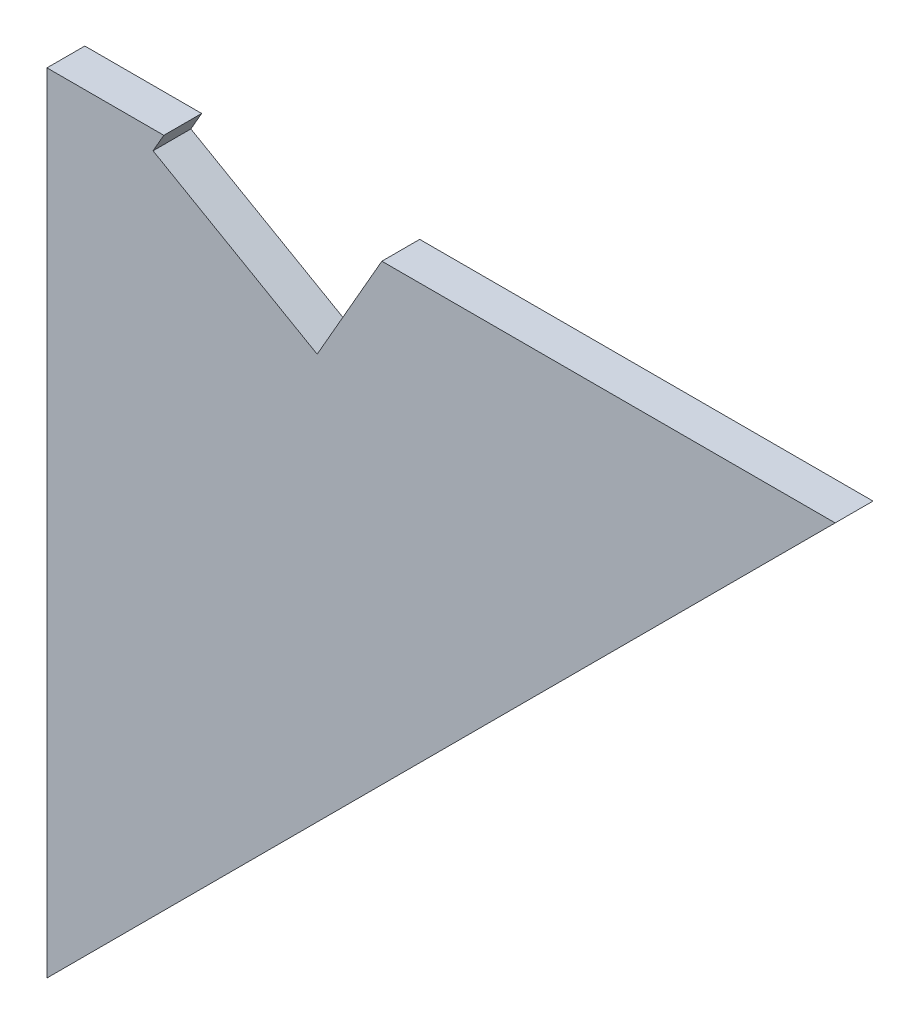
ISO-10303-21;
HEADER;
FILE_DESCRIPTION(('STEP AP214'),'2;1');
FILE_NAME('part.step','',(''),(''),'','','');
FILE_SCHEMA(('AUTOMOTIVE_DESIGN { 1 0 10303 214 1 1 1 1 }'));
ENDSEC;
DATA;
#1=APPLICATION_CONTEXT('core data for automotive mechanical design processes');
#2=APPLICATION_PROTOCOL_DEFINITION('international standard','automotive_design',2000,#1);
#3=PRODUCT_CONTEXT('',#1,'mechanical');
#4=PRODUCT('Part','Part','',(#3));
#5=PRODUCT_RELATED_PRODUCT_CATEGORY('part','',(#4));
#6=PRODUCT_DEFINITION_FORMATION('','',#4);
#7=PRODUCT_DEFINITION_CONTEXT('part definition',#1,'design');
#8=PRODUCT_DEFINITION('design','',#6,#7);
#9=PRODUCT_DEFINITION_SHAPE('','',#8);
#10=(LENGTH_UNIT() NAMED_UNIT(*) SI_UNIT(.MILLI.,.METRE.));
#11=(NAMED_UNIT(*) PLANE_ANGLE_UNIT() SI_UNIT($,.RADIAN.));
#12=(NAMED_UNIT(*) SI_UNIT($,.STERADIAN.) SOLID_ANGLE_UNIT());
#13=UNCERTAINTY_MEASURE_WITH_UNIT(LENGTH_MEASURE(1.E-05),#10,'distance_accuracy_value','');
#14=(GEOMETRIC_REPRESENTATION_CONTEXT(3) GLOBAL_UNCERTAINTY_ASSIGNED_CONTEXT((#13)) GLOBAL_UNIT_ASSIGNED_CONTEXT((#10,
#11,#12)) REPRESENTATION_CONTEXT('',''));
#15=CARTESIAN_POINT('',(0.,0.,0.));
#16=DIRECTION('',(0.,0.,1.));
#17=DIRECTION('',(1.,0.,0.));
#18=AXIS2_PLACEMENT_3D('',#15,#16,#17);
#19=CARTESIAN_POINT('',(85.6976168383,89.196291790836,36.001));
#20=DIRECTION('',(0.497235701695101,0.867615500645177,0.));
#21=DIRECTION('',(0.,0.,-1.));
#22=AXIS2_PLACEMENT_3D('',#19,#20,#21);
#23=PLANE('',#22);
#24=DIRECTION('',(0.,0.,-1.));
#25=VECTOR('',#24,1.);
#26=CARTESIAN_POINT('',(33.638951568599,119.03142836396,36.001));
#27=LINE('',#26,#25);
#28=CARTESIAN_POINT('',(33.638951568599,119.03142836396,12.));
#29=VERTEX_POINT('',#28);
#30=CARTESIAN_POINT('',(33.638951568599,119.03142836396,0.));
#31=VERTEX_POINT('',#30);
#32=EDGE_CURVE('E25',#29,#31,#27,.T.);
#33=ORIENTED_EDGE('',*,*,#32,.F.);
#34=DIRECTION('',(0.867615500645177,-0.497235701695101,0.));
#35=VECTOR('',#34,1.);
#36=CARTESIAN_POINT('',(98.053103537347,82.115287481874,12.));
#37=LINE('',#36,#35);
#38=CARTESIAN_POINT('',(85.6976168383,89.196291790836,12.));
#39=VERTEX_POINT('',#38);
#40=EDGE_CURVE('E91',#29,#39,#37,.T.);
#41=ORIENTED_EDGE('',*,*,#40,.T.);
#42=DIRECTION('',(0.,0.,-1.));
#43=VECTOR('',#42,1.);
#44=CARTESIAN_POINT('',(85.6976168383,89.196291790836,36.001));
#45=LINE('',#44,#43);
#46=CARTESIAN_POINT('',(85.6976168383,89.196291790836,0.));
#47=VERTEX_POINT('',#46);
#48=EDGE_CURVE('E10',#39,#47,#45,.T.);
#49=ORIENTED_EDGE('',*,*,#48,.T.);
#50=DIRECTION('',(0.867615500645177,-0.497235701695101,0.));
#51=VECTOR('',#50,1.);
#52=CARTESIAN_POINT('',(98.053103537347,82.115287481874,0.));
#53=LINE('',#52,#51);
#54=EDGE_CURVE('E107',#31,#47,#53,.T.);
#55=ORIENTED_EDGE('',*,*,#54,.F.);
#56=EDGE_LOOP('',(#33,#41,#49,#55));
#57=FACE_BOUND('',#56,.T.);
#58=ADVANCED_FACE('F16',(#57),#23,.T.);
#59=CARTESIAN_POINT('',(85.6976168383,89.196291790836,36.001));
#60=DIRECTION('',(-0.867615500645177,0.497235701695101,0.));
#61=DIRECTION('',(0.,0.,1.));
#62=AXIS2_PLACEMENT_3D('',#59,#60,#61);
#63=PLANE('',#62);
#64=ORIENTED_EDGE('',*,*,#48,.F.);
#65=DIRECTION('',(0.497235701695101,0.867615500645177,0.));
#66=VECTOR('',#65,1.);
#67=CARTESIAN_POINT('',(74.687495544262,69.98497638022,12.));
#68=LINE('',#67,#66);
#69=CARTESIAN_POINT('',(106.21693900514,125.,12.));
#70=VERTEX_POINT('',#69);
#71=EDGE_CURVE('E86',#39,#70,#68,.T.);
#72=ORIENTED_EDGE('',*,*,#71,.T.);
#73=DIRECTION('',(0.,0.,1.));
#74=VECTOR('',#73,1.);
#75=CARTESIAN_POINT('',(106.21693900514,125.,18.0005));
#76=LINE('',#75,#74);
#77=CARTESIAN_POINT('',(106.21693900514,125.,0.));
#78=VERTEX_POINT('',#77);
#79=EDGE_CURVE('E70',#78,#70,#76,.T.);
#80=ORIENTED_EDGE('',*,*,#79,.F.);
#81=DIRECTION('',(0.497235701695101,0.867615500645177,0.));
#82=VECTOR('',#81,1.);
#83=CARTESIAN_POINT('',(74.687495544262,69.98497638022,0.));
#84=LINE('',#83,#82);
#85=EDGE_CURVE('E103',#47,#78,#84,.T.);
#86=ORIENTED_EDGE('',*,*,#85,.F.);
#87=EDGE_LOOP('',(#64,#72,#80,#86));
#88=FACE_BOUND('',#87,.T.);
#89=ADVANCED_FACE('F87',(#88),#63,.T.);
#90=CARTESIAN_POINT('',(33.638951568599,119.03142836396,36.001));
#91=DIRECTION('',(-0.867615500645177,0.497235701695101,0.));
#92=DIRECTION('',(0.,0.,1.));
#93=AXIS2_PLACEMENT_3D('',#90,#91,#92);
#94=PLANE('',#93);
#95=DIRECTION('',(0.497235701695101,0.867615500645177,0.));
#96=VECTOR('',#95,1.);
#97=CARTESIAN_POINT('',(22.62883027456,99.820112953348,0.));
#98=LINE('',#97,#96);
#99=CARTESIAN_POINT('',(37.059576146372,125.,0.));
#100=VERTEX_POINT('',#99);
#101=EDGE_CURVE('E116',#31,#100,#98,.T.);
#102=ORIENTED_EDGE('',*,*,#101,.T.);
#103=DIRECTION('',(0.,0.,1.));
#104=VECTOR('',#103,1.);
#105=CARTESIAN_POINT('',(37.059576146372,125.,18.0005));
#106=LINE('',#105,#104);
#107=CARTESIAN_POINT('',(37.059576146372,125.,12.));
#108=VERTEX_POINT('',#107);
#109=EDGE_CURVE('E129',#100,#108,#106,.T.);
#110=ORIENTED_EDGE('',*,*,#109,.T.);
#111=DIRECTION('',(0.497235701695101,0.867615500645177,0.));
#112=VECTOR('',#111,1.);
#113=CARTESIAN_POINT('',(22.62883027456,99.820112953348,12.));
#114=LINE('',#113,#112);
#115=EDGE_CURVE('E83',#29,#108,#114,.T.);
#116=ORIENTED_EDGE('',*,*,#115,.F.);
#117=ORIENTED_EDGE('',*,*,#32,.T.);
#118=EDGE_LOOP('',(#102,#110,#116,#117));
#119=FACE_BOUND('',#118,.T.);
#120=ADVANCED_FACE('F113',(#119),#94,.F.);
#121=CARTESIAN_POINT('',(0.,125.,0.));
#122=DIRECTION('',(0.,1.,0.));
#123=DIRECTION('',(1.,0.,0.));
#124=AXIS2_PLACEMENT_3D('',#121,#122,#123);
#125=PLANE('',#124);
#126=DIRECTION('',(1.,0.,0.));
#127=VECTOR('',#126,1.);
#128=CARTESIAN_POINT('',(0.,125.,0.));
#129=LINE('',#128,#127);
#130=CARTESIAN_POINT('',(250.,125.,0.));
#131=VERTEX_POINT('',#130);
#132=EDGE_CURVE('E78',#78,#131,#129,.T.);
#133=ORIENTED_EDGE('',*,*,#132,.F.);
#134=ORIENTED_EDGE('',*,*,#79,.T.);
#135=DIRECTION('',(1.,0.,0.));
#136=VECTOR('',#135,1.);
#137=CARTESIAN_POINT('',(0.,125.,12.));
#138=LINE('',#137,#136);
#139=CARTESIAN_POINT('',(250.,125.,12.));
#140=VERTEX_POINT('',#139);
#141=EDGE_CURVE('E75',#70,#140,#138,.T.);
#142=ORIENTED_EDGE('',*,*,#141,.T.);
#143=DIRECTION('',(0.,0.,1.));
#144=VECTOR('',#143,1.);
#145=CARTESIAN_POINT('',(250.,125.,0.));
#146=LINE('',#145,#144);
#147=EDGE_CURVE('E140',#131,#140,#146,.T.);
#148=ORIENTED_EDGE('',*,*,#147,.F.);
#149=EDGE_LOOP('',(#133,#134,#142,#148));
#150=FACE_BOUND('',#149,.T.);
#151=ADVANCED_FACE('F72',(#150),#125,.T.);
#152=CARTESIAN_POINT('',(88.388347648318,36.611652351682,12.));
#153=DIRECTION('',(0.,0.,-1.));
#154=DIRECTION('',(0.,-1.,0.));
#155=AXIS2_PLACEMENT_3D('',#152,#153,#154);
#156=PLANE('',#155);
#157=ORIENTED_EDGE('',*,*,#141,.F.);
#158=ORIENTED_EDGE('',*,*,#71,.F.);
#159=ORIENTED_EDGE('',*,*,#40,.F.);
#160=ORIENTED_EDGE('',*,*,#115,.T.);
#161=DIRECTION('',(1.,0.,0.));
#162=VECTOR('',#161,1.);
#163=CARTESIAN_POINT('',(0.,125.,12.));
#164=LINE('',#163,#162);
#165=CARTESIAN_POINT('',(0.,125.,12.));
#166=VERTEX_POINT('',#165);
#167=EDGE_CURVE('E133',#166,#108,#164,.T.);
#168=ORIENTED_EDGE('',*,*,#167,.F.);
#169=DIRECTION('',(0.,1.,0.));
#170=VECTOR('',#169,1.);
#171=CARTESIAN_POINT('',(0.,-125.,12.));
#172=LINE('',#171,#170);
#173=CARTESIAN_POINT('',(0.,-125.,12.));
#174=VERTEX_POINT('',#173);
#175=EDGE_CURVE('E155',#174,#166,#172,.T.);
#176=ORIENTED_EDGE('',*,*,#175,.F.);
#177=DIRECTION('',(-0.707106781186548,-0.707106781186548,0.));
#178=VECTOR('',#177,1.);
#179=CARTESIAN_POINT('',(250.,125.,12.));
#180=LINE('',#179,#178);
#181=EDGE_CURVE('E96',#140,#174,#180,.T.);
#182=ORIENTED_EDGE('',*,*,#181,.F.);
#183=EDGE_LOOP('',(#157,#158,#159,#160,#168,#176,#182));
#184=FACE_BOUND('',#183,.T.);
#185=ADVANCED_FACE('F93',(#184),#156,.F.);
#186=CARTESIAN_POINT('',(88.388347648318,36.611652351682,0.));
#187=DIRECTION('',(0.,0.,-1.));
#188=DIRECTION('',(0.,-1.,0.));
#189=AXIS2_PLACEMENT_3D('',#186,#187,#188);
#190=PLANE('',#189);
#191=DIRECTION('',(-0.707106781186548,-0.707106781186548,0.));
#192=VECTOR('',#191,1.);
#193=CARTESIAN_POINT('',(250.,125.,0.));
#194=LINE('',#193,#192);
#195=CARTESIAN_POINT('',(0.,-125.,0.));
#196=VERTEX_POINT('',#195);
#197=EDGE_CURVE('E146',#131,#196,#194,.T.);
#198=ORIENTED_EDGE('',*,*,#197,.T.);
#199=DIRECTION('',(0.,1.,0.));
#200=VECTOR('',#199,1.);
#201=CARTESIAN_POINT('',(0.,-125.,0.));
#202=LINE('',#201,#200);
#203=CARTESIAN_POINT('',(0.,125.,0.));
#204=VERTEX_POINT('',#203);
#205=EDGE_CURVE('E143',#196,#204,#202,.T.);
#206=ORIENTED_EDGE('',*,*,#205,.T.);
#207=DIRECTION('',(1.,0.,0.));
#208=VECTOR('',#207,1.);
#209=CARTESIAN_POINT('',(0.,125.,0.));
#210=LINE('',#209,#208);
#211=EDGE_CURVE('E127',#204,#100,#210,.T.);
#212=ORIENTED_EDGE('',*,*,#211,.T.);
#213=ORIENTED_EDGE('',*,*,#101,.F.);
#214=ORIENTED_EDGE('',*,*,#54,.T.);
#215=ORIENTED_EDGE('',*,*,#85,.T.);
#216=ORIENTED_EDGE('',*,*,#132,.T.);
#217=EDGE_LOOP('',(#198,#206,#212,#213,#214,#215,#216));
#218=FACE_BOUND('',#217,.T.);
#219=ADVANCED_FACE('F124',(#218),#190,.T.);
#220=CARTESIAN_POINT('',(0.,125.,0.));
#221=DIRECTION('',(0.,1.,0.));
#222=DIRECTION('',(1.,0.,0.));
#223=AXIS2_PLACEMENT_3D('',#220,#221,#222);
#224=PLANE('',#223);
#225=ORIENTED_EDGE('',*,*,#211,.F.);
#226=DIRECTION('',(0.,0.,1.));
#227=VECTOR('',#226,1.);
#228=CARTESIAN_POINT('',(0.,125.,0.));
#229=LINE('',#228,#227);
#230=EDGE_CURVE('E148',#204,#166,#229,.T.);
#231=ORIENTED_EDGE('',*,*,#230,.T.);
#232=ORIENTED_EDGE('',*,*,#167,.T.);
#233=ORIENTED_EDGE('',*,*,#109,.F.);
#234=EDGE_LOOP('',(#225,#231,#232,#233));
#235=FACE_BOUND('',#234,.T.);
#236=ADVANCED_FACE('F189',(#235),#224,.T.);
#237=CARTESIAN_POINT('',(250.,125.,0.));
#238=DIRECTION('',(0.707106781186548,-0.707106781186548,0.));
#239=DIRECTION('',(0.,0.,-1.));
#240=AXIS2_PLACEMENT_3D('',#237,#238,#239);
#241=PLANE('',#240);
#242=ORIENTED_EDGE('',*,*,#147,.T.);
#243=ORIENTED_EDGE('',*,*,#181,.T.);
#244=DIRECTION('',(0.,0.,1.));
#245=VECTOR('',#244,1.);
#246=CARTESIAN_POINT('',(0.,-125.,0.));
#247=LINE('',#246,#245);
#248=EDGE_CURVE('E161',#196,#174,#247,.T.);
#249=ORIENTED_EDGE('',*,*,#248,.F.);
#250=ORIENTED_EDGE('',*,*,#197,.F.);
#251=EDGE_LOOP('',(#242,#243,#249,#250));
#252=FACE_BOUND('',#251,.T.);
#253=ADVANCED_FACE('F177',(#252),#241,.T.);
#254=CARTESIAN_POINT('',(0.,-125.,0.));
#255=DIRECTION('',(-1.,0.,0.));
#256=DIRECTION('',(0.,0.,1.));
#257=AXIS2_PLACEMENT_3D('',#254,#255,#256);
#258=PLANE('',#257);
#259=ORIENTED_EDGE('',*,*,#248,.T.);
#260=ORIENTED_EDGE('',*,*,#175,.T.);
#261=ORIENTED_EDGE('',*,*,#230,.F.);
#262=ORIENTED_EDGE('',*,*,#205,.F.);
#263=EDGE_LOOP('',(#259,#260,#261,#262));
#264=FACE_BOUND('',#263,.T.);
#265=ADVANCED_FACE('F169',(#264),#258,.T.);
#266=CLOSED_SHELL('',(#58,#89,#120,#151,#185,#219,#236,#253,#265));
#267=MANIFOLD_SOLID_BREP('B1',#266);
#268=ADVANCED_BREP_SHAPE_REPRESENTATION('',(#18,#267),#14);
#269=SHAPE_DEFINITION_REPRESENTATION(#9,#268);
ENDSEC;
END-ISO-10303-21;
